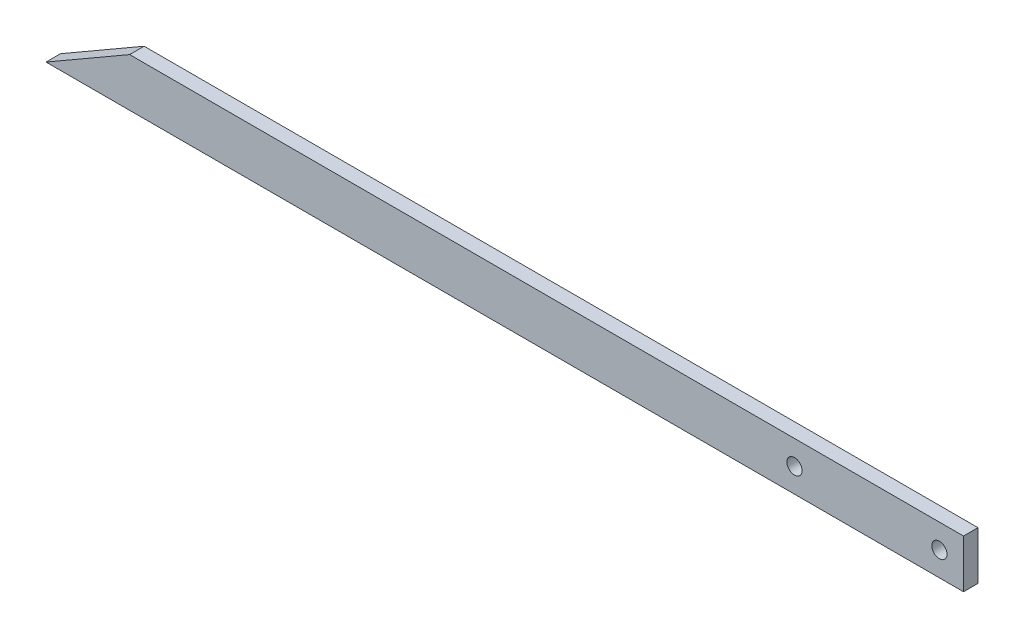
from build123d import *

# Parameters (mm, degrees)
BOSS_EXTRUDE1_DEPTH = 7.62
SKETCH4_R           = 4
CUT_EXTRUDE1_DEPTH  = 484.32802981


with BuildPart() as part:
    # Sketch3 → Boss-Extrude1 (new body)
    with BuildSketch(Plane.XY):
        Polygon((0, 0), (43.994090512, 25.4), (482.6, 25.4), (482.6, 0), align=None)
    extrude(amount=BOSS_EXTRUDE1_DEPTH)

    # Sketch4 → Cut-Extrude1 (cut, through all)
    with BuildSketch(Plane.XY.offset(7.62)):
        with Locations((469.9, 12.7)):
            Circle(SKETCH4_R)
        with Locations((393.7, 12.7)):
            Circle(SKETCH4_R)
    extrude(amount=-CUT_EXTRUDE1_DEPTH, mode=Mode.SUBTRACT)


solid = part.part
